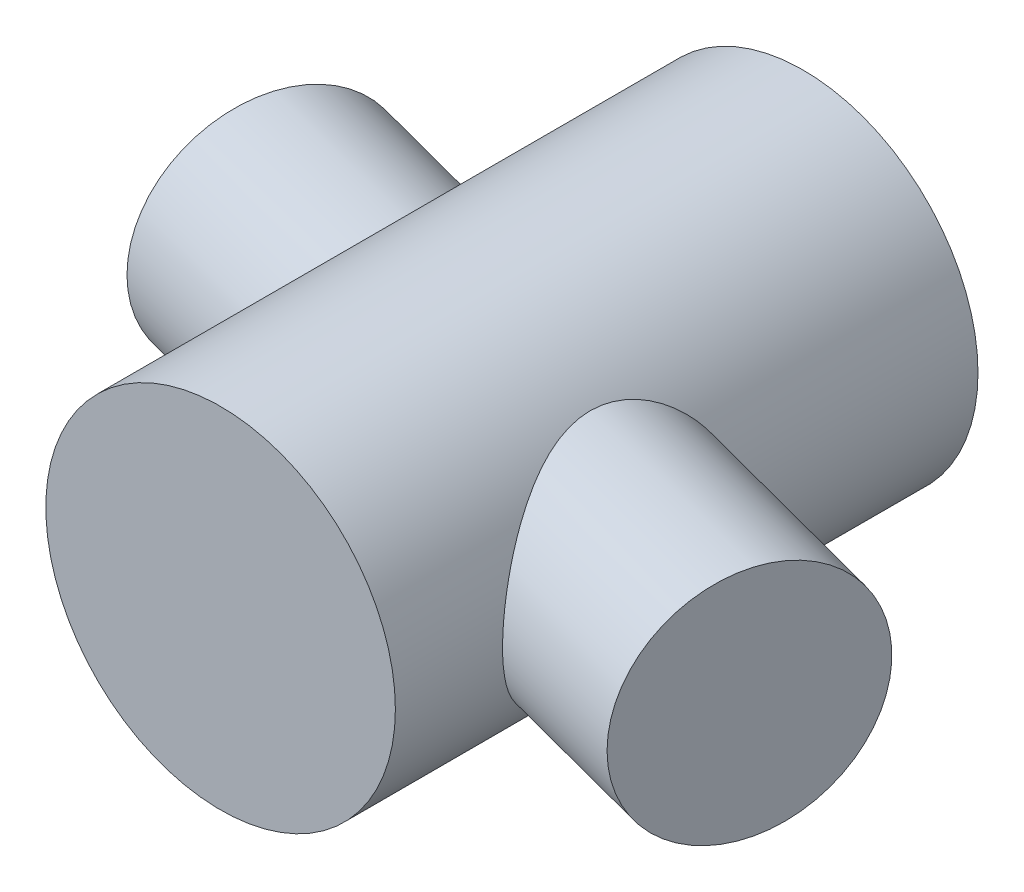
ISO-10303-21;
HEADER;
FILE_DESCRIPTION(('STEP AP214'),'2;1');
FILE_NAME('part.step','',(''),(''),'','','');
FILE_SCHEMA(('AUTOMOTIVE_DESIGN { 1 0 10303 214 1 1 1 1 }'));
ENDSEC;
DATA;
#1=APPLICATION_CONTEXT('core data for automotive mechanical design processes');
#2=APPLICATION_PROTOCOL_DEFINITION('international standard','automotive_design',2000,#1);
#3=PRODUCT_CONTEXT('',#1,'mechanical');
#4=PRODUCT('Part','Part','',(#3));
#5=PRODUCT_RELATED_PRODUCT_CATEGORY('part','',(#4));
#6=PRODUCT_DEFINITION_FORMATION('','',#4);
#7=PRODUCT_DEFINITION_CONTEXT('part definition',#1,'design');
#8=PRODUCT_DEFINITION('design','',#6,#7);
#9=PRODUCT_DEFINITION_SHAPE('','',#8);
#10=(LENGTH_UNIT() NAMED_UNIT(*) SI_UNIT(.MILLI.,.METRE.));
#11=(NAMED_UNIT(*) PLANE_ANGLE_UNIT() SI_UNIT($,.RADIAN.));
#12=(NAMED_UNIT(*) SI_UNIT($,.STERADIAN.) SOLID_ANGLE_UNIT());
#13=UNCERTAINTY_MEASURE_WITH_UNIT(LENGTH_MEASURE(1.E-05),#10,'distance_accuracy_value','');
#14=(GEOMETRIC_REPRESENTATION_CONTEXT(3) GLOBAL_UNCERTAINTY_ASSIGNED_CONTEXT((#13)) GLOBAL_UNIT_ASSIGNED_CONTEXT((#10,
#11,#12)) REPRESENTATION_CONTEXT('',''));
#15=CARTESIAN_POINT('',(0.,0.,0.));
#16=DIRECTION('',(0.,0.,1.));
#17=DIRECTION('',(1.,0.,0.));
#18=AXIS2_PLACEMENT_3D('',#15,#16,#17);
#19=CARTESIAN_POINT('',(0.,0.,50.));
#20=DIRECTION('',(0.,0.,-1.));
#21=DIRECTION('',(-1.,0.,0.));
#22=AXIS2_PLACEMENT_3D('',#19,#20,#21);
#23=CYLINDRICAL_SURFACE('',#22,15.);
#24=CARTESIAN_POINT('',(-15.,0.,32.8829490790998));
#25=CARTESIAN_POINT('',(-14.9999990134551,-0.268321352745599,32.8829483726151));
#26=CARTESIAN_POINT('',(-14.9927863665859,-0.53665875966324,32.873672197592));
#27=CARTESIAN_POINT('',(-14.9640906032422,-1.07129715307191,32.8366475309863));
#28=CARTESIAN_POINT('',(-14.9426063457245,-1.33759797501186,32.8088975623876));
#29=CARTESIAN_POINT('',(-14.8858233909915,-1.86627147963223,32.735151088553));
#30=CARTESIAN_POINT('',(-14.8505192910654,-2.128642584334,32.6891474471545));
#31=CARTESIAN_POINT('',(-14.7668517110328,-2.64747874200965,32.5792682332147));
#32=CARTESIAN_POINT('',(-14.7184883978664,-2.90394387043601,32.5153928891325));
#33=CARTESIAN_POINT('',(-14.609870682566,-3.40853220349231,32.3704516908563));
#34=CARTESIAN_POINT('',(-14.549651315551,-3.6566775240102,32.2894364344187));
#35=CARTESIAN_POINT('',(-14.4184521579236,-4.1438981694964,32.1106230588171));
#36=CARTESIAN_POINT('',(-14.3474723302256,-4.38297346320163,32.0128248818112));
#37=CARTESIAN_POINT('',(-14.1961350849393,-4.85079476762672,31.8009402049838));
#38=CARTESIAN_POINT('',(-14.1157747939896,-5.07953758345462,31.6868487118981));
#39=CARTESIAN_POINT('',(-13.9472664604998,-5.52544782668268,31.4428973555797));
#40=CARTESIAN_POINT('',(-13.8591181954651,-5.74261492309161,31.3130370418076));
#41=CARTESIAN_POINT('',(-13.6721821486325,-6.1749197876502,31.031080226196));
#42=CARTESIAN_POINT('',(-13.5730823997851,-6.3894084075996,30.8781947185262));
#43=CARTESIAN_POINT('',(-13.3703879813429,-6.80337006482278,30.5559314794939));
#44=CARTESIAN_POINT('',(-13.2667929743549,-7.00284197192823,30.3865525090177));
#45=CARTESIAN_POINT('',(-13.0575216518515,-7.38571109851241,30.031633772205));
#46=CARTESIAN_POINT('',(-12.9518451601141,-7.56910694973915,29.8460926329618));
#47=CARTESIAN_POINT('',(-12.7410989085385,-7.91871488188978,29.4591618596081));
#48=CARTESIAN_POINT('',(-12.6360290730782,-8.08492915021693,29.2577742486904));
#49=CARTESIAN_POINT('',(-12.4428354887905,-8.37870163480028,28.8665655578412));
#50=CARTESIAN_POINT('',(-12.354278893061,-8.50847851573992,28.6786224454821));
#51=CARTESIAN_POINT('',(-12.1820133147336,-8.75333960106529,28.2913049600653));
#52=CARTESIAN_POINT('',(-12.0983034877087,-8.86842636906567,28.0919325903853));
#53=CARTESIAN_POINT('',(-11.9380721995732,-9.08297034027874,27.6824595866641));
#54=CARTESIAN_POINT('',(-11.8615432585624,-9.18244388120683,27.4723704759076));
#55=CARTESIAN_POINT('',(-11.7178896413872,-9.36507196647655,27.0420912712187));
#56=CARTESIAN_POINT('',(-11.650764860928,-9.44822669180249,26.8219012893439));
#57=CARTESIAN_POINT('',(-11.5276389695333,-9.59807470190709,26.3708426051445));
#58=CARTESIAN_POINT('',(-11.471731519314,-9.66463042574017,26.1399023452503));
#59=CARTESIAN_POINT('',(-11.3736579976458,-9.7798592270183,25.6707419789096));
#60=CARTESIAN_POINT('',(-11.3314915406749,-9.82853280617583,25.4325220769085));
#61=CARTESIAN_POINT('',(-11.2622676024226,-9.90778011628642,24.951046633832));
#62=CARTESIAN_POINT('',(-11.2352030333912,-9.93836233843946,24.7077935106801));
#63=CARTESIAN_POINT('',(-11.1967406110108,-9.9816754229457,24.2184969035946));
#64=CARTESIAN_POINT('',(-11.1853420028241,-9.99440714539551,23.9724535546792));
#65=CARTESIAN_POINT('',(-11.1784406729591,-10.0021232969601,23.5104927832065));
#66=CARTESIAN_POINT('',(-11.1811394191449,-9.99911564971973,23.294629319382));
#67=CARTESIAN_POINT('',(-11.1977683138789,-9.98048616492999,22.8638554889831));
#68=CARTESIAN_POINT('',(-11.2117024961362,-9.96485979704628,22.648945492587));
#69=CARTESIAN_POINT('',(-11.2691120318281,-9.90003562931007,22.0072468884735));
#70=CARTESIAN_POINT('',(-11.3281944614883,-9.83289264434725,21.583501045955));
#71=CARTESIAN_POINT('',(-11.4607076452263,-9.67779354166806,20.8522024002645));
#72=CARTESIAN_POINT('',(-11.527217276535,-9.59879236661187,20.5413238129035));
#73=CARTESIAN_POINT('',(-11.6750229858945,-9.41846418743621,19.9295504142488));
#74=CARTESIAN_POINT('',(-11.756326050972,-9.31712662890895,19.6286604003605));
#75=CARTESIAN_POINT('',(-11.9302260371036,-9.09339346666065,19.0374931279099));
#76=CARTESIAN_POINT('',(-12.0228463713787,-8.97095398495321,18.7472395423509));
#77=CARTESIAN_POINT('',(-12.215967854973,-8.7061465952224,18.1787751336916));
#78=CARTESIAN_POINT('',(-12.3164679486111,-8.5637813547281,17.900562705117));
#79=CARTESIAN_POINT('',(-12.5256188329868,-8.25498066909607,17.3485715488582));
#80=CARTESIAN_POINT('',(-12.6344249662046,-8.08794170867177,17.0751893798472));
#81=CARTESIAN_POINT('',(-12.8544695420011,-7.73344434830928,16.5429855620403));
#82=CARTESIAN_POINT('',(-12.9657082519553,-7.5459836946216,16.2841655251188));
#83=CARTESIAN_POINT('',(-13.1877571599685,-7.15082708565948,15.7827905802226));
#84=CARTESIAN_POINT('',(-13.2985677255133,-6.94315751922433,15.5402151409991));
#85=CARTESIAN_POINT('',(-13.5171598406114,-6.50737239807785,15.0729417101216));
#86=CARTESIAN_POINT('',(-13.6249421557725,-6.2792620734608,14.8482391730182));
#87=CARTESIAN_POINT('',(-13.8955272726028,-5.66419551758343,14.294680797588));
#88=CARTESIAN_POINT('',(-14.0541667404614,-5.26156932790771,13.9805973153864));
#89=CARTESIAN_POINT('',(-14.2724481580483,-4.62041914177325,13.556800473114));
#90=CARTESIAN_POINT('',(-14.341917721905,-4.40054569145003,13.4234436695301));
#91=CARTESIAN_POINT('',(-14.4728264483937,-3.94873681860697,13.1742278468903));
#92=CARTESIAN_POINT('',(-14.5342671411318,-3.71680370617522,13.0583654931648));
#93=CARTESIAN_POINT('',(-14.6374094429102,-3.284279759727,12.8651235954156));
#94=CARTESIAN_POINT('',(-14.6806771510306,-3.08547691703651,12.7845660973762));
#95=CARTESIAN_POINT('',(-14.7598556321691,-2.6812404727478,12.6377777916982));
#96=CARTESIAN_POINT('',(-14.7957679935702,-2.47580831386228,12.5715438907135));
#97=CARTESIAN_POINT('',(-14.8594394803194,-2.05946121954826,12.454485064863));
#98=CARTESIAN_POINT('',(-14.8872027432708,-1.84854912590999,12.403652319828));
#99=CARTESIAN_POINT('',(-14.9339371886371,-1.4224771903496,12.3182640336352));
#100=CARTESIAN_POINT('',(-14.9529083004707,-1.20731731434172,12.2837086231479));
#101=CARTESIAN_POINT('',(-14.9816347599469,-0.77337262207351,12.2314389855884));
#102=CARTESIAN_POINT('',(-14.9913490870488,-0.554576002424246,12.213799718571));
#103=CARTESIAN_POINT('',(-15.0011542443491,-0.116053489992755,12.1959956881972));
#104=CARTESIAN_POINT('',(-15.0012450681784,0.10367240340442,12.1958309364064));
#105=CARTESIAN_POINT('',(-14.9918007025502,0.542241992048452,12.2129795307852));
#106=CARTESIAN_POINT('',(-14.9822649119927,0.761085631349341,12.2302939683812));
#107=CARTESIAN_POINT('',(-14.9538233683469,1.19611095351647,12.2820421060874));
#108=CARTESIAN_POINT('',(-14.9349177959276,1.41229268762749,12.3164754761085));
#109=CARTESIAN_POINT('',(-14.889775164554,1.82620857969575,12.3989494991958));
#110=CARTESIAN_POINT('',(-14.8641063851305,2.02421647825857,12.4459382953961));
#111=CARTESIAN_POINT('',(-14.805559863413,2.41547998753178,12.5535157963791));
#112=CARTESIAN_POINT('',(-14.7726794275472,2.60873379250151,12.6141095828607));
#113=CARTESIAN_POINT('',(-14.7003567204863,2.98949273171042,12.7480154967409));
#114=CARTESIAN_POINT('',(-14.660914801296,3.1769981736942,12.8213269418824));
#115=CARTESIAN_POINT('',(-14.5761618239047,3.54560180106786,12.9797511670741));
#116=CARTESIAN_POINT('',(-14.5308495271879,3.7266986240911,13.0648664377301));
#117=CARTESIAN_POINT('',(-14.4155034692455,4.15456283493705,13.2829797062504));
#118=CARTESIAN_POINT('',(-14.3429330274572,4.39793211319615,13.4213332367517));
#119=CARTESIAN_POINT('',(-14.1895855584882,4.87004410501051,13.7171360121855));
#120=CARTESIAN_POINT('',(-14.1088057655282,5.09878184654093,13.8745916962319));
#121=CARTESIAN_POINT('',(-13.9408167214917,5.54164477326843,14.2067016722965));
#122=CARTESIAN_POINT('',(-13.8535946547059,5.75573910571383,14.3813904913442));
#123=CARTESIAN_POINT('',(-13.6747191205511,6.16868711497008,14.7457802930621));
#124=CARTESIAN_POINT('',(-13.583065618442,6.36754067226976,14.935481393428));
#125=CARTESIAN_POINT('',(-13.3702224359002,6.80531121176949,15.385046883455));
#126=CARTESIAN_POINT('',(-13.248140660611,7.03923365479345,15.6493631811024));
#127=CARTESIAN_POINT('',(-13.0031071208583,7.48219843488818,16.1977783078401));
#128=CARTESIAN_POINT('',(-12.8801550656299,7.69123199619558,16.4818840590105));
#129=CARTESIAN_POINT('',(-12.6370006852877,8.08453303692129,17.068049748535));
#130=CARTESIAN_POINT('',(-12.5167996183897,8.26878936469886,17.3701176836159));
#131=CARTESIAN_POINT('',(-12.2831110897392,8.61210009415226,17.9906415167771));
#132=CARTESIAN_POINT('',(-12.1696216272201,8.77116203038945,18.3090924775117));
#133=CARTESIAN_POINT('',(-11.9761562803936,9.03284969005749,18.8934130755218));
#134=CARTESIAN_POINT('',(-11.8941209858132,9.14033149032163,19.1564339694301));
#135=CARTESIAN_POINT('',(-11.739396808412,9.33821922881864,19.6915491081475));
#136=CARTESIAN_POINT('',(-11.6667078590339,9.42862528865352,19.9636432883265));
#137=CARTESIAN_POINT('',(-11.5335237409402,9.59108169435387,20.5155495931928));
#138=CARTESIAN_POINT('',(-11.4730028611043,9.66317083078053,20.7953439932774));
#139=CARTESIAN_POINT('',(-11.3668781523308,9.78778892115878,21.3620407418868));
#140=CARTESIAN_POINT('',(-11.3212697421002,9.84032388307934,21.6489408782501));
#141=CARTESIAN_POINT('',(-11.2564339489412,9.91435845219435,22.1605404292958));
#142=CARTESIAN_POINT('',(-11.2335349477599,9.94023834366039,22.3841448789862));
#143=CARTESIAN_POINT('',(-11.1994034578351,9.97867915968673,22.8333634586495));
#144=CARTESIAN_POINT('',(-11.1881679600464,9.99124351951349,23.0589770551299));
#145=CARTESIAN_POINT('',(-11.1782975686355,10.0022859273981,23.5106474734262));
#146=CARTESIAN_POINT('',(-11.1796514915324,10.0007764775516,23.7367037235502));
#147=CARTESIAN_POINT('',(-11.1954608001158,9.98307575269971,24.1878011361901));
#148=CARTESIAN_POINT('',(-11.2099161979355,9.96688446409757,24.4128422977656));
#149=CARTESIAN_POINT('',(-11.2520042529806,9.9193451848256,24.8608859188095));
#150=CARTESIAN_POINT('',(-11.2796828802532,9.88794431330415,25.0838784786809));
#151=CARTESIAN_POINT('',(-11.3476562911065,9.80986069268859,25.525214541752));
#152=CARTESIAN_POINT('',(-11.3879512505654,9.7631777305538,25.7435579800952));
#153=CARTESIAN_POINT('',(-11.4800781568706,9.65468082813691,26.1741248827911));
#154=CARTESIAN_POINT('',(-11.5319187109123,9.59285559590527,26.3863436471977));
#155=CARTESIAN_POINT('',(-11.6456016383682,9.45452087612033,26.8031616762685));
#156=CARTESIAN_POINT('',(-11.7074441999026,9.37801111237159,27.0077607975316));
#157=CARTESIAN_POINT('',(-11.8369333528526,9.21398452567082,27.4009369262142));
#158=CARTESIAN_POINT('',(-11.9042813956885,9.12697831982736,27.5898265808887));
#159=CARTESIAN_POINT('',(-12.0450011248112,8.94044725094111,27.9590654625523));
#160=CARTESIAN_POINT('',(-12.1183751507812,8.84091751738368,28.1394113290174));
#161=CARTESIAN_POINT('',(-12.2694900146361,8.62997349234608,28.4910663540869));
#162=CARTESIAN_POINT('',(-12.3472306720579,8.51855969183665,28.6623758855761));
#163=CARTESIAN_POINT('',(-12.5055335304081,8.28441955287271,28.9957178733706));
#164=CARTESIAN_POINT('',(-12.5860960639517,8.16169187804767,29.1577492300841));
#165=CARTESIAN_POINT('',(-12.7629201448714,7.88287380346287,29.5001009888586));
#166=CARTESIAN_POINT('',(-12.8594443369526,7.72471697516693,29.6786062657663));
#167=CARTESIAN_POINT('',(-13.052201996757,7.39436316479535,30.0222868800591));
#168=CARTESIAN_POINT('',(-13.1484354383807,7.22216495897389,30.1874610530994));
#169=CARTESIAN_POINT('',(-13.3386990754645,6.86441394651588,30.5043623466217));
#170=CARTESIAN_POINT('',(-13.4327276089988,6.67885147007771,30.6560795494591));
#171=CARTESIAN_POINT('',(-13.6166956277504,6.29530370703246,30.9456570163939));
#172=CARTESIAN_POINT('',(-13.7066350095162,6.09731810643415,31.0835169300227));
#173=CARTESIAN_POINT('',(-13.8921711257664,5.66307031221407,31.3621830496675));
#174=CARTESIAN_POINT('',(-13.9869666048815,5.42519069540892,31.5010114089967));
#175=CARTESIAN_POINT('',(-14.1670116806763,4.93596303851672,31.7599505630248));
#176=CARTESIAN_POINT('',(-14.2522601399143,4.68461339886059,31.8800591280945));
#177=CARTESIAN_POINT('',(-14.4111729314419,4.17019346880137,32.1008144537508));
#178=CARTESIAN_POINT('',(-14.4848451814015,3.90713134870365,32.2014745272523));
#179=CARTESIAN_POINT('',(-14.618930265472,3.37093534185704,32.3827411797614));
#180=CARTESIAN_POINT('',(-14.6793456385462,3.09780339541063,32.4633515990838));
#181=CARTESIAN_POINT('',(-14.7759991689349,2.59299463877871,32.5913428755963));
#182=CARTESIAN_POINT('',(-14.8146279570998,2.36261998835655,32.6420867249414));
#183=CARTESIAN_POINT('',(-14.8813275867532,1.89768802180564,32.7293160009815));
#184=CARTESIAN_POINT('',(-14.9093994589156,1.66313111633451,32.7658028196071));
#185=CARTESIAN_POINT('',(-14.9545039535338,1.1912117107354,32.8242748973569));
#186=CARTESIAN_POINT('',(-14.9715388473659,0.95384979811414,32.8462631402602));
#187=CARTESIAN_POINT('',(-14.9942878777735,0.477662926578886,32.8756012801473));
#188=CARTESIAN_POINT('',(-15.0000008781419,0.238837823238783,32.882949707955));
#189=CARTESIAN_POINT('',(-15.,0.,32.8829490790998));
#190=B_SPLINE_CURVE_WITH_KNOTS('',3,(#24,#25,#26,#27,#28,#29,#30,#31,#32,#33,#34,#35,#36,#37,
#38,#39,#40,#41,#42,#43,#44,#45,#46,#47,#48,#49,#50,#51,#52,#53,#54,#55,#56,#57,#58,#59,#60,#61,
#62,#63,#64,#65,#66,#67,#68,#69,#70,#71,#72,#73,#74,#75,#76,#77,#78,#79,#80,#81,#82,#83,#84,#85,
#86,#87,#88,#89,#90,#91,#92,#93,#94,#95,#96,#97,#98,#99,#100,#101,#102,#103,#104,#105,#106,#107,
#108,#109,#110,#111,#112,#113,#114,#115,#116,#117,#118,#119,#120,#121,#122,#123,#124,#125,#126,
#127,#128,#129,#130,#131,#132,#133,#134,#135,#136,#137,#138,#139,#140,#141,#142,#143,#144,#145,
#146,#147,#148,#149,#150,#151,#152,#153,#154,#155,#156,#157,#158,#159,#160,#161,#162,#163,#164,
#165,#166,#167,#168,#169,#170,#171,#172,#173,#174,#175,#176,#177,#178,#179,#180,#181,#182,#183,
#184,#185,#186,#187,#188,#189),.UNSPECIFIED.,.T.,.F.,(4,2,2,2,2,2,2,2,2,2,2,2,2,2,2,2,2,2,2,2,2,
2,2,2,2,2,2,2,2,2,2,2,2,2,2,2,2,2,2,2,2,2,2,2,2,2,2,2,2,2,2,2,2,2,2,2,2,2,2,2,2,2,2,2,2,2,2,2,2,
2,2,2,2,2,2,2,2,2,2,2,2,2,4),(0.,0.804736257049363,1.60953686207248,2.4146524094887,
3.21975766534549,4.02251857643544,4.82528225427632,5.6282924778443,6.43132565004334,
7.2746712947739,8.11808034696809,8.96156111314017,9.80493436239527,10.5391216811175,
11.2731806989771,12.0064664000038,12.7397439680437,13.4789103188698,14.2180559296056,
14.9568543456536,15.6956171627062,16.3426203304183,16.9898558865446,18.2843607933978,
19.2659355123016,20.2479750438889,21.2320817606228,22.216056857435,23.2301590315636,
24.2443732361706,25.2572804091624,26.2699291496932,27.8672599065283,28.6656233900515,
29.4638345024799,30.1196785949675,30.775380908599,31.4307497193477,32.0861237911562,
32.7443887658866,33.4026541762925,34.0609606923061,34.7192545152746,35.3339637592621,
35.9489029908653,36.5638092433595,37.1788454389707,38.0451575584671,38.9117625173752,
39.7801404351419,40.6485251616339,41.7674599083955,42.8867880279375,44.0066182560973,
45.1261129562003,46.0126379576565,46.8991566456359,47.7837819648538,48.6681352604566,
49.3462832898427,50.0242563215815,50.7016271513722,51.3789986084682,52.058742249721,
52.7384953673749,53.4187569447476,54.0990313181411,54.75419212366,55.409608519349,
56.0649978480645,56.7204646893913,57.4915455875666,58.2626937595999,59.0344056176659,
59.8061369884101,60.6789185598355,61.5518040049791,62.4240898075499,63.2962084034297,
64.0126646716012,64.7290509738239,65.4452897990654,66.1616004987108),.UNSPECIFIED.);
#191=CARTESIAN_POINT('',(-15.,0.,32.8829490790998));
#192=VERTEX_POINT('',#191);
#193=EDGE_CURVE('E45',#192,#192,#190,.T.);
#194=ORIENTED_EDGE('',*,*,#193,.T.);
#195=EDGE_LOOP('',(#194));
#196=FACE_BOUND('',#195,.T.);
#197=CARTESIAN_POINT('',(15.,0.,40.8008028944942));
#198=CARTESIAN_POINT('',(14.9999981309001,0.230134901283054,40.8008000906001));
#199=CARTESIAN_POINT('',(14.9946889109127,0.460306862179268,40.791167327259));
#200=CARTESIAN_POINT('',(14.9736047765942,0.918596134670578,40.7528496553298));
#201=CARTESIAN_POINT('',(14.9578275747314,1.14671298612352,40.7241605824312));
#202=CARTESIAN_POINT('',(14.916246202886,1.5991413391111,40.6483348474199));
#203=CARTESIAN_POINT('',(14.8904325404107,1.82344902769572,40.6011807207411));
#204=CARTESIAN_POINT('',(14.8294874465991,2.26633775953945,40.4894079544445));
#205=CARTESIAN_POINT('',(14.7943562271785,2.48491893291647,40.4247897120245));
#206=CARTESIAN_POINT('',(14.7159652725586,2.91331485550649,40.279859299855));
#207=CARTESIAN_POINT('',(14.6727718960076,3.12318518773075,40.1996750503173));
#208=CARTESIAN_POINT('',(14.5790398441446,3.53500600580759,40.0245727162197));
#209=CARTESIAN_POINT('',(14.5284984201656,3.73695349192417,39.9296491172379));
#210=CARTESIAN_POINT('',(14.3673350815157,4.32979572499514,39.6246829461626));
#211=CARTESIAN_POINT('',(14.2471354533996,4.70789290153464,39.3943745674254));
#212=CARTESIAN_POINT('',(14.0254662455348,5.32560836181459,38.9604266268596));
#213=CARTESIAN_POINT('',(13.9281532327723,5.57439205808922,38.7673282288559));
#214=CARTESIAN_POINT('',(13.727216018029,6.05232508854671,38.3611231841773));
#215=CARTESIAN_POINT('',(13.6235919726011,6.28147490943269,38.1480170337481));
#216=CARTESIAN_POINT('',(13.4124333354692,6.72057631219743,37.7037701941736));
#217=CARTESIAN_POINT('',(13.3048909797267,6.93048651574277,37.4725925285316));
#218=CARTESIAN_POINT('',(13.0886178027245,7.33074394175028,36.9944842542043));
#219=CARTESIAN_POINT('',(12.9798871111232,7.52109327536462,36.7475553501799));
#220=CARTESIAN_POINT('',(12.7611838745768,7.8866089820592,36.2333699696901));
#221=CARTESIAN_POINT('',(12.6512422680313,8.06131296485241,35.9657719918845));
#222=CARTESIAN_POINT('',(12.4355010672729,8.39029208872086,35.4166527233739));
#223=CARTESIAN_POINT('',(12.3297019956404,8.54456465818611,35.1351296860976));
#224=CARTESIAN_POINT('',(12.1253985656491,8.83208797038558,34.5593574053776));
#225=CARTESIAN_POINT('',(12.0268872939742,8.96535877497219,34.2651206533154));
#226=CARTESIAN_POINT('',(11.8404644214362,9.2101610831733,33.6645142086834));
#227=CARTESIAN_POINT('',(11.7525497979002,9.32169879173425,33.3581480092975));
#228=CARTESIAN_POINT('',(11.6104454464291,9.49774304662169,32.8087916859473));
#229=CARTESIAN_POINT('',(11.5532161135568,9.56711974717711,32.5681433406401));
#230=CARTESIAN_POINT('',(11.4489865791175,9.69160999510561,32.0809778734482));
#231=CARTESIAN_POINT('',(11.4019857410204,9.74672443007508,31.8344611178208));
#232=CARTESIAN_POINT('',(11.3202192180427,9.84157314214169,31.336866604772));
#233=CARTESIAN_POINT('',(11.2854341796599,9.88133175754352,31.0857967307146));
#234=CARTESIAN_POINT('',(11.2298845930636,9.94441969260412,30.5800463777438));
#235=CARTESIAN_POINT('',(11.2091176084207,9.96775186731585,30.3253665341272));
#236=CARTESIAN_POINT('',(11.1851158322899,9.99467086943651,29.8519443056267));
#237=CARTESIAN_POINT('',(11.1797455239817,10.00066401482,29.6334465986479));
#238=CARTESIAN_POINT('',(11.1810383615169,9.99921958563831,29.1965247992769));
#239=CARTESIAN_POINT('',(11.1877002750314,9.99178338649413,28.9781007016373));
#240=CARTESIAN_POINT('',(11.2133378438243,9.96300278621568,28.5429773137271));
#241=CARTESIAN_POINT('',(11.232308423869,9.94166411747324,28.3262773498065));
#242=CARTESIAN_POINT('',(11.2823566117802,9.88482973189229,27.8961494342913));
#243=CARTESIAN_POINT('',(11.3134344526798,9.84933374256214,27.6827215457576));
#244=CARTESIAN_POINT('',(11.3869752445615,9.76421768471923,27.260858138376));
#245=CARTESIAN_POINT('',(11.4294306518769,9.71460697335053,27.0524194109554));
#246=CARTESIAN_POINT('',(11.5246134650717,9.60149663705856,26.6417618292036));
#247=CARTESIAN_POINT('',(11.5773410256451,9.53799680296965,26.4395430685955));
#248=CARTESIAN_POINT('',(11.6916750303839,9.39749610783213,26.0423116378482));
#249=CARTESIAN_POINT('',(11.7532868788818,9.32048702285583,25.8473034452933));
#250=CARTESIAN_POINT('',(11.8837914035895,9.15350903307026,25.4653683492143));
#251=CARTESIAN_POINT('',(11.9526869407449,9.06353503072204,25.2784446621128));
#252=CARTESIAN_POINT('',(12.0989862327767,8.86736122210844,24.9059470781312));
#253=CARTESIAN_POINT('',(12.1766212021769,8.76065295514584,24.7207324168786));
#254=CARTESIAN_POINT('',(12.3361782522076,8.53451003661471,24.3600901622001));
#255=CARTESIAN_POINT('',(12.4181020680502,8.41507021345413,24.1846665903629));
#256=CARTESIAN_POINT('',(12.5844957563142,8.16413670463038,23.8439329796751));
#257=CARTESIAN_POINT('',(12.6689658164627,8.03264212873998,23.6786236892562));
#258=CARTESIAN_POINT('',(12.8388560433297,7.75821041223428,23.3583038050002));
#259=CARTESIAN_POINT('',(12.9242763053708,7.61527211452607,23.2032942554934));
#260=CARTESIAN_POINT('',(13.1110687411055,7.28982417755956,22.874753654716));
#261=CARTESIAN_POINT('',(13.2123310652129,7.10500777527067,22.7034382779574));
#262=CARTESIAN_POINT('',(13.4118237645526,6.72085131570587,22.3759773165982));
#263=CARTESIAN_POINT('',(13.5100538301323,6.52150978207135,22.2198332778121));
#264=CARTESIAN_POINT('',(13.7014525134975,6.10916409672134,21.9229818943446));
#265=CARTESIAN_POINT('',(13.7946184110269,5.8961527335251,21.7822828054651));
#266=CARTESIAN_POINT('',(13.9739280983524,5.45760544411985,21.5168412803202));
#267=CARTESIAN_POINT('',(14.0600720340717,5.23206977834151,21.3920985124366));
#268=CARTESIAN_POINT('',(14.2298243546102,4.75202288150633,21.1501936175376));
#269=CARTESIAN_POINT('',(14.3127430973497,4.49661198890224,21.0343270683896));
#270=CARTESIAN_POINT('',(14.4665071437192,3.97420589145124,20.8222959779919));
#271=CARTESIAN_POINT('',(14.5373517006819,3.70720997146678,20.7261326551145));
#272=CARTESIAN_POINT('',(14.665244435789,3.1636254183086,20.5542365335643));
#273=CARTESIAN_POINT('',(14.7222984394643,2.8870408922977,20.4784951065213));
#274=CARTESIAN_POINT('',(14.8212452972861,2.32630961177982,20.3480294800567));
#275=CARTESIAN_POINT('',(14.8631394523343,2.04216350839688,20.293303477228));
#276=CARTESIAN_POINT('',(14.9285864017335,1.48677408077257,20.2081527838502));
#277=CARTESIAN_POINT('',(14.9531300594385,1.21584853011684,20.1764121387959));
#278=CARTESIAN_POINT('',(14.98744266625,0.671505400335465,20.1321038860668));
#279=CARTESIAN_POINT('',(14.9972121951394,0.398087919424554,20.1195355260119));
#280=CARTESIAN_POINT('',(15.001753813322,-0.149012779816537,20.1136882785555));
#281=CARTESIAN_POINT('',(14.9965293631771,-0.422695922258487,20.1204049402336));
#282=CARTESIAN_POINT('',(14.9712093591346,-0.968215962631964,20.1530556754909));
#283=CARTESIAN_POINT('',(14.9511141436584,-1.24005290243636,20.1789893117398));
#284=CARTESIAN_POINT('',(14.8979093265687,-1.76593922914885,20.2480209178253));
#285=CARTESIAN_POINT('',(14.8655186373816,-2.02018680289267,20.2901722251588));
#286=CARTESIAN_POINT('',(14.788413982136,-2.52341091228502,20.3912341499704));
#287=CARTESIAN_POINT('',(14.7437005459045,-2.77238767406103,20.4501440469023));
#288=CARTESIAN_POINT('',(14.6428257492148,-3.26351096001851,20.5843109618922));
#289=CARTESIAN_POINT('',(14.5866644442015,-3.50565751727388,20.6595679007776));
#290=CARTESIAN_POINT('',(14.4639664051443,-3.98172168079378,20.8259654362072));
#291=CARTESIAN_POINT('',(14.3974292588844,-4.2156389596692,20.9171066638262));
#292=CARTESIAN_POINT('',(14.2525954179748,-4.68245995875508,21.1184447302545));
#293=CARTESIAN_POINT('',(14.1739550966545,-4.91500698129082,21.2292211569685));
#294=CARTESIAN_POINT('',(14.0084133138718,-5.36867479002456,21.4668186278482));
#295=CARTESIAN_POINT('',(13.9215116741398,-5.58979532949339,21.5936400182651));
#296=CARTESIAN_POINT('',(13.7410856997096,-6.01971399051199,21.8629838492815));
#297=CARTESIAN_POINT('',(13.6475555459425,-6.22850098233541,22.0055201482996));
#298=CARTESIAN_POINT('',(13.4558262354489,-6.63255247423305,22.3058118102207));
#299=CARTESIAN_POINT('',(13.35762690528,-6.82781647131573,22.4635677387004));
#300=CARTESIAN_POINT('',(13.1509921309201,-7.21829972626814,22.8066517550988));
#301=CARTESIAN_POINT('',(13.0423488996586,-7.41236915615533,22.9931663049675));
#302=CARTESIAN_POINT('',(12.8248708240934,-7.78259526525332,23.3831712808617));
#303=CARTESIAN_POINT('',(12.7160359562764,-7.95874956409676,23.5866639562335));
#304=CARTESIAN_POINT('',(12.501451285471,-8.29173772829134,24.0100778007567));
#305=CARTESIAN_POINT('',(12.3956987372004,-8.44858921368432,24.2299836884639));
#306=CARTESIAN_POINT('',(12.1906875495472,-8.74180372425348,24.6858725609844));
#307=CARTESIAN_POINT('',(12.0914268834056,-8.87817316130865,24.9218504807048));
#308=CARTESIAN_POINT('',(11.9242905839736,-9.10088519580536,25.3543265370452));
#309=CARTESIAN_POINT('',(11.8543707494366,-9.19158663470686,25.5477997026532));
#310=CARTESIAN_POINT('',(11.7224920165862,-9.35919615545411,25.9432314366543));
#311=CARTESIAN_POINT('',(11.6605313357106,-9.436107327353,26.1451880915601));
#312=CARTESIAN_POINT('',(11.5463534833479,-9.57548116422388,26.5563994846));
#313=CARTESIAN_POINT('',(11.4941235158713,-9.63796283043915,26.7656442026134));
#314=CARTESIAN_POINT('',(11.4008015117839,-9.74817675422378,27.1904275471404));
#315=CARTESIAN_POINT('',(11.3597095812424,-9.79590887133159,27.4059662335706));
#316=CARTESIAN_POINT('',(11.2896892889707,-9.87652694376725,27.8424130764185));
#317=CARTESIAN_POINT('',(11.2607964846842,-9.90936951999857,28.063334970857));
#318=CARTESIAN_POINT('',(11.2159761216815,-9.96007167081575,28.5081807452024));
#319=CARTESIAN_POINT('',(11.2000482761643,-9.97793157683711,28.7321045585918));
#320=CARTESIAN_POINT('',(11.1812148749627,-9.99903164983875,29.1813254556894));
#321=CARTESIAN_POINT('',(11.1783183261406,-10.0022617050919,29.4066233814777));
#322=CARTESIAN_POINT('',(11.1851032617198,-9.99467243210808,29.8567852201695));
#323=CARTESIAN_POINT('',(11.1947863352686,-9.98385132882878,30.0816490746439));
#324=CARTESIAN_POINT('',(11.2292984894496,-9.94503360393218,30.5790804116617));
#325=CARTESIAN_POINT('',(11.2570046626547,-9.91376656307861,30.8511946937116));
#326=CARTESIAN_POINT('',(11.3277495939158,-9.83285023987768,31.3906334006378));
#327=CARTESIAN_POINT('',(11.3707920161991,-9.78319656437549,31.6579566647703));
#328=CARTESIAN_POINT('',(11.4699334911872,-9.6667715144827,32.1869567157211));
#329=CARTESIAN_POINT('',(11.5260604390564,-9.59996353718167,32.4486201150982));
#330=CARTESIAN_POINT('',(11.6489507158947,-9.4504658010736,32.9647682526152));
#331=CARTESIAN_POINT('',(11.7157146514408,-9.36777513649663,33.2192525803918));
#332=CARTESIAN_POINT('',(11.8823323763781,-9.15609482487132,33.8075188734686));
#333=CARTESIAN_POINT('',(11.9856246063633,-9.02100011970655,34.1381399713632));
#334=CARTESIAN_POINT('',(12.2026878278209,-8.72514147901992,34.7841626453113));
#335=CARTESIAN_POINT('',(12.3164627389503,-8.56436792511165,35.0995584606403));
#336=CARTESIAN_POINT('',(12.550289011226,-8.21790419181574,35.7140365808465));
#337=CARTESIAN_POINT('',(12.6703422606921,-8.03220648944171,36.0131139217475));
#338=CARTESIAN_POINT('',(12.9128678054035,-7.6362127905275,36.5933797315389));
#339=CARTESIAN_POINT('',(13.0353394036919,-7.42592379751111,36.8745732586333));
#340=CARTESIAN_POINT('',(13.2589633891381,-7.01746222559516,37.3722960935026));
#341=CARTESIAN_POINT('',(13.3602914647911,-6.82303860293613,37.5918281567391));
#342=CARTESIAN_POINT('',(13.5600861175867,-6.4167979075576,38.0156497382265));
#343=CARTESIAN_POINT('',(13.6585526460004,-6.20498053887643,38.219938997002));
#344=CARTESIAN_POINT('',(13.8503116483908,-5.76424605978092,38.6110364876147));
#345=CARTESIAN_POINT('',(13.9436123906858,-5.53535773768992,38.7978730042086));
#346=CARTESIAN_POINT('',(14.1229365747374,-5.06034088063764,39.1520726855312));
#347=CARTESIAN_POINT('',(14.2089627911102,-4.8142189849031,39.319443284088));
#348=CARTESIAN_POINT('',(14.3515192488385,-4.36745380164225,39.5938008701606));
#349=CARTESIAN_POINT('',(14.4101213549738,-4.17038772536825,39.7055509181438));
#350=CARTESIAN_POINT('',(14.5207225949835,-3.76726106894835,39.9150155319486));
#351=CARTESIAN_POINT('',(14.572725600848,-3.56120585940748,40.0127383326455));
#352=CARTESIAN_POINT('',(14.6690387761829,-3.14097409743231,40.1927359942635));
#353=CARTESIAN_POINT('',(14.7133572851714,-2.92680666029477,40.2750276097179));
#354=CARTESIAN_POINT('',(14.7933375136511,-2.49121530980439,40.4229159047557));
#355=CARTESIAN_POINT('',(14.8290012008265,-2.26979305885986,40.4885163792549));
#356=CARTESIAN_POINT('',(14.882735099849,-1.87944417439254,40.5870635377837));
#357=CARTESIAN_POINT('',(14.9029688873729,-1.7118277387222,40.6240658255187));
#358=CARTESIAN_POINT('',(14.9378935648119,-1.37409645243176,40.6878303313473));
#359=CARTESIAN_POINT('',(14.9525852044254,-1.20398194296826,40.7145939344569));
#360=CARTESIAN_POINT('',(14.9761936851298,-0.861978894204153,40.7575598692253));
#361=CARTESIAN_POINT('',(14.985109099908,-0.690089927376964,40.773759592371));
#362=CARTESIAN_POINT('',(14.9970123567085,-0.345474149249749,40.7953810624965));
#363=CARTESIAN_POINT('',(15.0000014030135,-0.172747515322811,40.8008049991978));
#364=CARTESIAN_POINT('',(15.,0.,40.8008028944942));
#365=B_SPLINE_CURVE_WITH_KNOTS('',3,(#197,#198,#199,#200,#201,#202,#203,#204,#205,#206,#207,
#208,#209,#210,#211,#212,#213,#214,#215,#216,#217,#218,#219,#220,#221,#222,#223,#224,#225,#226,
#227,#228,#229,#230,#231,#232,#233,#234,#235,#236,#237,#238,#239,#240,#241,#242,#243,#244,#245,
#246,#247,#248,#249,#250,#251,#252,#253,#254,#255,#256,#257,#258,#259,#260,#261,#262,#263,#264,
#265,#266,#267,#268,#269,#270,#271,#272,#273,#274,#275,#276,#277,#278,#279,#280,#281,#282,#283,
#284,#285,#286,#287,#288,#289,#290,#291,#292,#293,#294,#295,#296,#297,#298,#299,#300,#301,#302,
#303,#304,#305,#306,#307,#308,#309,#310,#311,#312,#313,#314,#315,#316,#317,#318,#319,#320,#321,
#322,#323,#324,#325,#326,#327,#328,#329,#330,#331,#332,#333,#334,#335,#336,#337,#338,#339,#340,
#341,#342,#343,#344,#345,#346,#347,#348,#349,#350,#351,#352,#353,#354,#355,#356,#357,#358,#359,
#360,#361,#362,#363,#364),.UNSPECIFIED.,.T.,.F.,(4,2,2,2,2,2,2,2,2,2,2,2,2,2,2,2,2,2,2,2,2,2,2,
2,2,2,2,2,2,2,2,2,2,2,2,2,2,2,2,2,2,2,2,2,2,2,2,2,2,2,2,2,2,2,2,2,2,2,2,2,2,2,2,2,2,2,2,2,2,2,2,
2,2,2,2,2,2,2,2,2,2,2,2,4),(0.,0.690209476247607,1.3805698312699,2.07158472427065,
2.7625839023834,3.44812809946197,4.1339293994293,5.50488484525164,6.49261325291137,
7.48031716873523,8.47009778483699,9.45977146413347,10.4727217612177,11.4857994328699,
12.4979034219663,13.5097180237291,14.2798464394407,15.0499269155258,15.8187817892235,
16.5875029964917,17.2427481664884,17.8979262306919,18.5528343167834,19.207755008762,
19.8622425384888,20.516739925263,21.1716371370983,21.8267925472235,22.5084008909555,
23.1902871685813,23.8722238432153,24.5542295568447,25.3681322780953,26.182117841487,
26.9965364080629,27.8109380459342,28.6872015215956,29.5635191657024,30.439465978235,
31.3153376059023,32.1359196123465,32.9564694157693,33.7768298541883,34.5971716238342,
35.3755174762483,36.1538298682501,36.9321384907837,37.7104780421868,38.517572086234,
39.3246835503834,40.1325125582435,40.9403715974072,41.8101309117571,42.6800056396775,
43.5490803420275,44.4178824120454,45.0917059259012,45.7653782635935,46.4381583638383,
47.1109448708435,47.7856790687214,48.4603983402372,49.1355838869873,49.8108547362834,
50.635531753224,51.4604059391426,52.2870550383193,53.1137512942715,54.2276077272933,
55.3418823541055,56.4564940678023,57.5707891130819,58.500777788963,59.43078229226,
60.3592524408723,61.2873668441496,61.9887619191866,62.6897435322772,63.3899595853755,
64.0900162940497,64.6081598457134,65.1262332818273,65.6444345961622,66.1625305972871),.UNSPECIFIED.);
#366=CARTESIAN_POINT('',(15.,0.,40.8008028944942));
#367=VERTEX_POINT('',#366);
#368=EDGE_CURVE('E61',#367,#367,#365,.T.);
#369=ORIENTED_EDGE('',*,*,#368,.T.);
#370=EDGE_LOOP('',(#369));
#371=FACE_BOUND('',#370,.T.);
#372=CARTESIAN_POINT('',(0.,0.,50.));
#373=DIRECTION('',(0.,0.,1.));
#374=DIRECTION('',(1.,0.,0.));
#375=AXIS2_PLACEMENT_3D('',#372,#373,#374);
#376=CIRCLE('',#375,15.);
#377=CARTESIAN_POINT('',(15.,0.,50.));
#378=VERTEX_POINT('',#377);
#379=EDGE_CURVE('E12',#378,#378,#376,.T.);
#380=ORIENTED_EDGE('',*,*,#379,.F.);
#381=EDGE_LOOP('',(#380));
#382=FACE_BOUND('',#381,.T.);
#383=CARTESIAN_POINT('',(0.,0.,0.));
#384=DIRECTION('',(0.,0.,1.));
#385=DIRECTION('',(1.,0.,0.));
#386=AXIS2_PLACEMENT_3D('',#383,#384,#385);
#387=CIRCLE('',#386,15.);
#388=CARTESIAN_POINT('',(15.,0.,0.));
#389=VERTEX_POINT('',#388);
#390=EDGE_CURVE('E52',#389,#389,#387,.T.);
#391=ORIENTED_EDGE('',*,*,#390,.T.);
#392=EDGE_LOOP('',(#391));
#393=FACE_BOUND('',#392,.T.);
#394=ADVANCED_FACE('F41',(#196,#371,#382,#393),#23,.T.);
#395=CARTESIAN_POINT('',(0.,0.,50.));
#396=DIRECTION('',(0.,0.,1.));
#397=DIRECTION('',(1.,0.,0.));
#398=AXIS2_PLACEMENT_3D('',#395,#396,#397);
#399=PLANE('',#398);
#400=ORIENTED_EDGE('',*,*,#379,.T.);
#401=EDGE_LOOP('',(#400));
#402=FACE_BOUND('',#401,.T.);
#403=ADVANCED_FACE('F79',(#402),#399,.T.);
#404=CARTESIAN_POINT('',(0.,0.,0.));
#405=DIRECTION('',(0.,0.,1.));
#406=DIRECTION('',(1.,0.,0.));
#407=AXIS2_PLACEMENT_3D('',#404,#405,#406);
#408=PLANE('',#407);
#409=ORIENTED_EDGE('',*,*,#390,.F.);
#410=EDGE_LOOP('',(#409));
#411=FACE_BOUND('',#410,.T.);
#412=ADVANCED_FACE('F77',(#411),#408,.F.);
#413=CARTESIAN_POINT('',(27.1811806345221,0.,44.0157631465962));
#414=DIRECTION('',(0.966890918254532,0.,0.255190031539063));
#415=DIRECTION('',(0.255190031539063,0.,-0.966890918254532));
#416=AXIS2_PLACEMENT_3D('',#413,#414,#415);
#417=PLANE('',#416);
#418=CARTESIAN_POINT('',(29.7330809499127,0.,34.3468539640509));
#419=DIRECTION('',(-0.966890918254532,0.,-0.255190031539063));
#420=DIRECTION('',(-0.255190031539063,0.,0.966890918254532));
#421=AXIS2_PLACEMENT_3D('',#418,#419,#420);
#422=CIRCLE('',#421,10.);
#423=CARTESIAN_POINT('',(27.1811806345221,0.,44.0157631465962));
#424=VERTEX_POINT('',#423);
#425=EDGE_CURVE('E59',#424,#424,#422,.T.);
#426=ORIENTED_EDGE('',*,*,#425,.F.);
#427=EDGE_LOOP('',(#426));
#428=FACE_BOUND('',#427,.T.);
#429=ADVANCED_FACE('F73',(#428),#417,.T.);
#430=CARTESIAN_POINT('',(-26.2387271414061,0.,19.5743008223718));
#431=DIRECTION('',(-0.966890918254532,0.,-0.255190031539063));
#432=DIRECTION('',(-0.255190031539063,0.,0.966890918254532));
#433=AXIS2_PLACEMENT_3D('',#430,#431,#432);
#434=CYLINDRICAL_SURFACE('',#433,10.);
#435=ORIENTED_EDGE('',*,*,#425,.T.);
#436=EDGE_LOOP('',(#435));
#437=FACE_BOUND('',#436,.T.);
#438=ORIENTED_EDGE('',*,*,#368,.F.);
#439=EDGE_LOOP('',(#438));
#440=FACE_BOUND('',#439,.T.);
#441=ADVANCED_FACE('F71',(#437,#440),#434,.T.);
#442=CARTESIAN_POINT('',(-26.2387271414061,0.,19.5743008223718));
#443=DIRECTION('',(-0.966890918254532,0.,-0.255190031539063));
#444=DIRECTION('',(-0.255190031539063,0.,0.966890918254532));
#445=AXIS2_PLACEMENT_3D('',#442,#443,#444);
#446=CIRCLE('',#445,10.);
#447=CARTESIAN_POINT('',(-28.7906274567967,0.,29.2432100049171));
#448=VERTEX_POINT('',#447);
#449=EDGE_CURVE('E103',#448,#448,#446,.T.);
#450=ORIENTED_EDGE('',*,*,#449,.F.);
#451=EDGE_LOOP('',(#450));
#452=FACE_BOUND('',#451,.T.);
#453=ORIENTED_EDGE('',*,*,#193,.F.);
#454=EDGE_LOOP('',(#453));
#455=FACE_BOUND('',#454,.T.);
#456=ADVANCED_FACE('F65',(#452,#455),#434,.T.);
#457=CARTESIAN_POINT('',(-28.7906274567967,0.,29.2432100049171));
#458=DIRECTION('',(-0.966890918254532,0.,-0.255190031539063));
#459=DIRECTION('',(-0.255190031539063,0.,0.966890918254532));
#460=AXIS2_PLACEMENT_3D('',#457,#458,#459);
#461=PLANE('',#460);
#462=ORIENTED_EDGE('',*,*,#449,.T.);
#463=EDGE_LOOP('',(#462));
#464=FACE_BOUND('',#463,.T.);
#465=ADVANCED_FACE('F70',(#464),#461,.T.);
#466=CLOSED_SHELL('',(#394,#403,#412,#429,#441,#456,#465));
#467=MANIFOLD_SOLID_BREP('B2',#466);
#468=ADVANCED_BREP_SHAPE_REPRESENTATION('',(#18,#467),#14);
#469=SHAPE_DEFINITION_REPRESENTATION(#9,#468);
ENDSEC;
END-ISO-10303-21;
